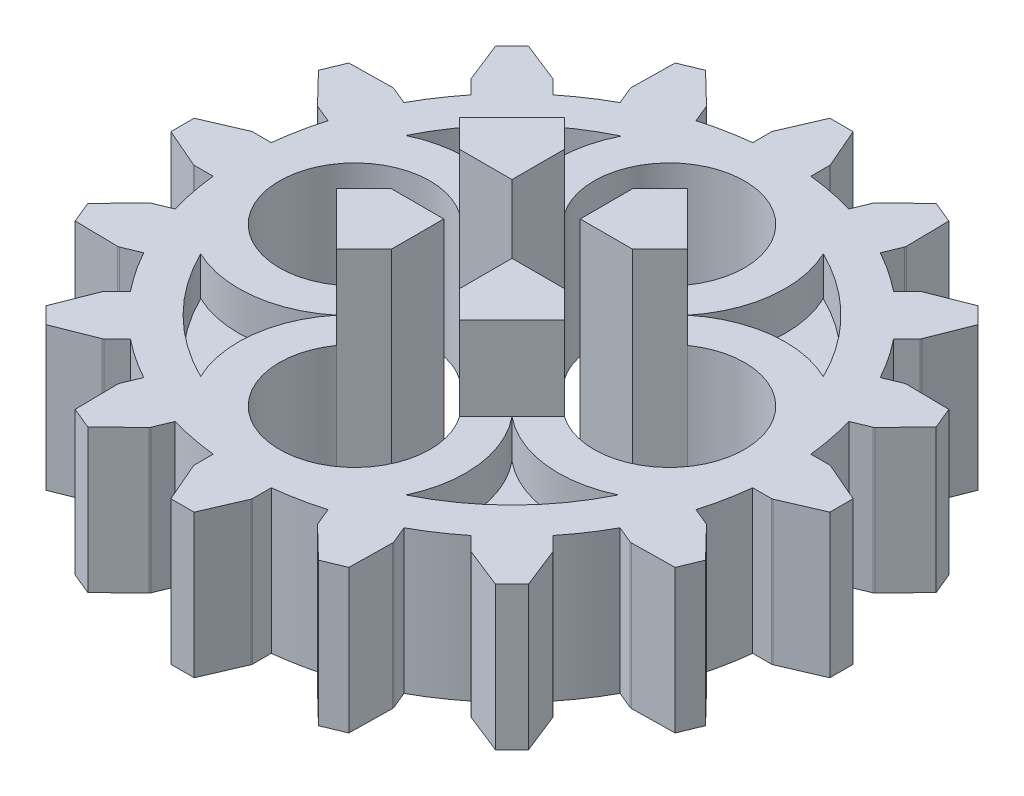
from build123d import *

# Parameters (mm, degrees)
BOSS_EXTRUDE4_DEPTH      = 3.7
CUT_EXTRUDE1_DEPTH       = 4
BOSS_EXTRUDE5_DEPTH      = 4
BOSS_EXTRUDE5_DEPTH_BACK = 4
CUT_EXTRUDE2_DEPTH       = 1
CUT_EXTRUDE3_DEPTH       = 4


with BuildPart() as part:
    # Sketch7 → Boss-Extrude4 (new body)
    with BuildSketch(Plane(origin=(0, 0, 0), x_dir=(1, 0, 0), z_dir=(0, 1, 0))):
        with BuildLine():
            ThreePointArc((-0.75, -6.959705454), (-0.375540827, -6.989919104), (0, -7))
            Line((0, -7), (0, 7))
            ThreePointArc((0, 7), (-0.375540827, 6.989919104), (-0.75, 6.959705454))
            ThreePointArc((-0.75, 6.959705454), (-1.365632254, 6.865496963), (-1.970454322, 6.716941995))
            ThreePointArc((-1.970454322, 6.716941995), (-2.678784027, 6.467156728), (-3.356273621, 6.142916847))
            ThreePointArc((-3.356273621, 6.142916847), (-3.888991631, 5.820287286), (-4.390924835, 5.451585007))
            ThreePointArc((-4.390924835, 5.451585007), (-4.949747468, 4.949747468), (-5.451585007, 4.390924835))
            ThreePointArc((-5.451585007, 4.390924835), (-5.820287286, 3.888991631), (-6.142916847, 3.356273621))
            ThreePointArc((-6.142916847, 3.356273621), (-6.467156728, 2.678784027), (-6.716941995, 1.970454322))
            ThreePointArc((-6.716941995, 1.970454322), (-6.865496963, 1.365632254), (-6.959705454, 0.75))
            ThreePointArc((-6.959705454, 0.75), (-7, 0), (-6.959705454, -0.75))
            ThreePointArc((-6.959705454, -0.75), (-6.865496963, -1.365632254), (-6.716941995, -1.970454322))
            ThreePointArc((-6.716941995, -1.970454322), (-6.467156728, -2.678784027), (-6.142916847, -3.356273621))
            ThreePointArc((-6.142916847, -3.356273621), (-5.820287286, -3.888991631), (-5.451585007, -4.390924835))
            ThreePointArc((-5.451585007, -4.390924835), (-4.949747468, -4.949747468), (-4.390924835, -5.451585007))
            ThreePointArc((-4.390924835, -5.451585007), (-3.888991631, -5.820287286), (-3.356273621, -6.142916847))
            ThreePointArc((-3.356273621, -6.142916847), (-2.678784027, -6.467156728), (-1.970454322, -6.716941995))
            ThreePointArc((-1.970454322, -6.716941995), (-1.365632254, -6.865496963), (-0.75, -6.959705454))
        make_face()
        with BuildLine():
            Line((0, 7), (0, -7))
            ThreePointArc((0, -7), (0.375540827, -6.989919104), (0.75, -6.959705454))
            ThreePointArc((0.75, -6.959705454), (1.365632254, -6.865496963), (1.970454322, -6.716941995))
            ThreePointArc((1.970454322, -6.716941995), (2.678784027, -6.467156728), (3.356273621, -6.142916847))
            ThreePointArc((3.356273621, -6.142916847), (3.888991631, -5.820287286), (4.390924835, -5.451585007))
            ThreePointArc((4.390924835, -5.451585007), (4.949747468, -4.949747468), (5.451585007, -4.390924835))
            ThreePointArc((5.451585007, -4.390924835), (5.820287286, -3.888991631), (6.142916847, -3.356273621))
            ThreePointArc((6.142916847, -3.356273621), (6.467156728, -2.678784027), (6.716941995, -1.970454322))
            ThreePointArc((6.716941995, -1.970454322), (6.865496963, -1.365632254), (6.959705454, -0.75))
            ThreePointArc((6.959705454, -0.75), (6.989919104, -0.375540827), (7, 0))
            ThreePointArc((7, 0), (6.989919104, 0.375540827), (6.959705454, 0.75))
            ThreePointArc((6.959705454, 0.75), (6.865496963, 1.365632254), (6.716941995, 1.970454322))
            ThreePointArc((6.716941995, 1.970454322), (6.467156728, 2.678784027), (6.142916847, 3.356273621))
            ThreePointArc((6.142916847, 3.356273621), (5.820287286, 3.888991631), (5.451585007, 4.390924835))
            ThreePointArc((5.451585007, 4.390924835), (4.949747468, 4.949747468), (4.390924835, 5.451585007))
            ThreePointArc((4.390924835, 5.451585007), (3.888991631, 5.820287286), (3.356273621, 6.142916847))
            ThreePointArc((3.356273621, 6.142916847), (2.678784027, 6.467156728), (1.970454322, 6.716941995))
            ThreePointArc((1.970454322, 6.716941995), (1.365632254, 6.865496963), (0.75, 6.959705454))
            ThreePointArc((0.75, 6.959705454), (0.375540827, 6.989919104), (0, 7))
        make_face()
        with BuildLine():
            ThreePointArc((-0.75, -6.959705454), (-0.375540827, -6.989919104), (0, -7))
            Line((0, -7), (0, 7))
            ThreePointArc((0, 7), (-0.375540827, 6.989919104), (-0.75, 6.959705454))
            ThreePointArc((-0.75, 6.959705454), (-1.365632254, 6.865496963), (-1.970454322, 6.716941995))
            ThreePointArc((-1.970454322, 6.716941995), (-2.678784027, 6.467156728), (-3.356273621, 6.142916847))
            ThreePointArc((-3.356273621, 6.142916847), (-3.888991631, 5.820287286), (-4.390924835, 5.451585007))
            ThreePointArc((-4.390924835, 5.451585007), (-4.949747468, 4.949747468), (-5.451585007, 4.390924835))
            ThreePointArc((-5.451585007, 4.390924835), (-5.820287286, 3.888991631), (-6.142916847, 3.356273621))
            ThreePointArc((-6.142916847, 3.356273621), (-6.467156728, 2.678784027), (-6.716941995, 1.970454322))
            ThreePointArc((-6.716941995, 1.970454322), (-6.865496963, 1.365632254), (-6.959705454, 0.75))
            ThreePointArc((-6.959705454, 0.75), (-7, 0), (-6.959705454, -0.75))
            ThreePointArc((-6.959705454, -0.75), (-6.865496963, -1.365632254), (-6.716941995, -1.970454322))
            ThreePointArc((-6.716941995, -1.970454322), (-6.467156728, -2.678784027), (-6.142916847, -3.356273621))
            ThreePointArc((-6.142916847, -3.356273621), (-5.820287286, -3.888991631), (-5.451585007, -4.390924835))
            ThreePointArc((-5.451585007, -4.390924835), (-4.949747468, -4.949747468), (-4.390924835, -5.451585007))
            ThreePointArc((-4.390924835, -5.451585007), (-3.888991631, -5.820287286), (-3.356273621, -6.142916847))
            ThreePointArc((-3.356273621, -6.142916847), (-2.678784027, -6.467156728), (-1.970454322, -6.716941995))
            ThreePointArc((-1.970454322, -6.716941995), (-1.365632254, -6.865496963), (-0.75, -6.959705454))
        make_face()
        with BuildLine():
            Line((0, 7), (0, -7))
            ThreePointArc((0, -7), (0.375540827, -6.989919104), (0.75, -6.959705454))
            ThreePointArc((0.75, -6.959705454), (1.365632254, -6.865496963), (1.970454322, -6.716941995))
            ThreePointArc((1.970454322, -6.716941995), (2.678784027, -6.467156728), (3.356273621, -6.142916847))
            ThreePointArc((3.356273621, -6.142916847), (3.888991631, -5.820287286), (4.390924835, -5.451585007))
            ThreePointArc((4.390924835, -5.451585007), (4.949747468, -4.949747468), (5.451585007, -4.390924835))
            ThreePointArc((5.451585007, -4.390924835), (5.820287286, -3.888991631), (6.142916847, -3.356273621))
            ThreePointArc((6.142916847, -3.356273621), (6.467156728, -2.678784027), (6.716941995, -1.970454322))
            ThreePointArc((6.716941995, -1.970454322), (6.865496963, -1.365632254), (6.959705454, -0.75))
            ThreePointArc((6.959705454, -0.75), (6.989919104, -0.375540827), (7, 0))
            ThreePointArc((7, 0), (6.989919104, 0.375540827), (6.959705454, 0.75))
            ThreePointArc((6.959705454, 0.75), (6.865496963, 1.365632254), (6.716941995, 1.970454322))
            ThreePointArc((6.716941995, 1.970454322), (6.467156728, 2.678784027), (6.142916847, 3.356273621))
            ThreePointArc((6.142916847, 3.356273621), (5.820287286, 3.888991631), (5.451585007, 4.390924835))
            ThreePointArc((5.451585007, 4.390924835), (4.949747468, 4.949747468), (4.390924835, 5.451585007))
            ThreePointArc((4.390924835, 5.451585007), (3.888991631, 5.820287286), (3.356273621, 6.142916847))
            ThreePointArc((3.356273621, 6.142916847), (2.678784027, 6.467156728), (1.970454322, 6.716941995))
            ThreePointArc((1.970454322, 6.716941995), (1.365632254, 6.865496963), (0.75, 6.959705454))
            ThreePointArc((0.75, 6.959705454), (0.375540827, 6.989919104), (0, 7))
        make_face()
        with BuildLine():
            Line((-2.153873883, -7.159755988), (-1.970454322, -6.716941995))
            ThreePointArc((-1.970454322, -6.716941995), (-2.678784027, -6.467156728), (-3.356273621, -6.142916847))
            Line((-3.356273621, -6.142916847), (-3.539693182, -6.585730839))
            ThreePointArc((-3.539693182, -6.585730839), (-3.545532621, -6.605254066), (-3.547293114, -6.625555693))
            Line((-3.547293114, -6.625555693), (-3.529973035, -7.738170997))
            Line((-3.529973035, -7.738170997), (-2.975645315, -7.967781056))
            Line((-2.975645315, -7.967781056), (-2.176660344, -7.193290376))
            ThreePointArc((-2.176660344, -7.193290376), (-2.163549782, -7.1776901), (-2.153873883, -7.159755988))
        make_face()
        with BuildLine():
            Line((-4.729839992, -5.790500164), (-4.390924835, -5.451585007))
            ThreePointArc((-4.390924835, -5.451585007), (-4.949747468, -4.949747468), (-5.451585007, -4.390924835))
            Line((-5.451585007, -4.390924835), (-5.790500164, -4.729839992))
            ThreePointArc((-5.790500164, -4.729839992), (-5.803366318, -4.745642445), (-5.812761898, -4.763724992))
            Line((-5.812761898, -4.763724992), (-6.222539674, -5.798275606))
            Line((-6.222539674, -5.798275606), (-5.798275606, -6.222539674))
            Line((-5.798275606, -6.222539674), (-4.763724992, -5.812761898))
            ThreePointArc((-4.763724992, -5.812761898), (-4.745642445, -5.803366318), (-4.729839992, -5.790500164))
        make_face()
        with BuildLine():
            Line((-6.585730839, -3.539693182), (-6.142916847, -3.356273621))
            ThreePointArc((-6.142916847, -3.356273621), (-6.467156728, -2.678784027), (-6.716941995, -1.970454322))
            Line((-6.716941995, -1.970454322), (-7.159755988, -2.153873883))
            ThreePointArc((-7.159755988, -2.153873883), (-7.1776901, -2.163549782), (-7.193290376, -2.176660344))
            Line((-7.193290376, -2.176660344), (-7.967781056, -2.975645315))
            Line((-7.967781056, -2.975645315), (-7.738170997, -3.529973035))
            Line((-7.738170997, -3.529973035), (-6.625555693, -3.547293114))
            ThreePointArc((-6.625555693, -3.547293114), (-6.605254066, -3.545532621), (-6.585730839, -3.539693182))
        make_face()
        with BuildLine():
            Line((-7.439003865, -0.75), (-6.959705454, -0.75))
            ThreePointArc((-6.959705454, -0.75), (-7, 0), (-6.959705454, 0.75))
            Line((-6.959705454, 0.75), (-7.439003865, 0.75))
            ThreePointArc((-7.439003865, 0.75), (-7.459275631, 0.747923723), (-7.478705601, 0.74178111))
            Line((-7.478705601, 0.74178111), (-8.5, 0.3))
            Line((-8.5, 0.3), (-8.5, -0.3))
            Line((-8.5, -0.3), (-7.478705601, -0.74178111))
            ThreePointArc((-7.478705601, -0.74178111), (-7.459275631, -0.747923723), (-7.439003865, -0.75))
        make_face()
        with BuildLine():
            ThreePointArc((-6.716941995, 1.970454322), (-6.467156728, 2.678784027), (-6.142916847, 3.356273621))
            Line((-6.142916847, 3.356273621), (-6.585730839, 3.539693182))
            ThreePointArc((-6.585730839, 3.539693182), (-6.605254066, 3.545532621), (-6.625555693, 3.547293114))
            Line((-6.625555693, 3.547293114), (-7.738170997, 3.529973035))
            Line((-7.738170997, 3.529973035), (-7.967781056, 2.975645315))
            Line((-7.967781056, 2.975645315), (-7.193290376, 2.176660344))
            ThreePointArc((-7.193290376, 2.176660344), (-7.1776901, 2.163549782), (-7.159755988, 2.153873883))
            Line((-7.159755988, 2.153873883), (-6.716941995, 1.970454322))
        make_face()
        with BuildLine():
            ThreePointArc((-5.451585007, 4.390924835), (-4.949747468, 4.949747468), (-4.390924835, 5.451585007))
            Line((-4.390924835, 5.451585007), (-4.729839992, 5.790500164))
            ThreePointArc((-4.729839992, 5.790500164), (-4.745642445, 5.803366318), (-4.763724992, 5.812761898))
            Line((-4.763724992, 5.812761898), (-5.798275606, 6.222539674))
            Line((-5.798275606, 6.222539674), (-6.222539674, 5.798275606))
            Line((-6.222539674, 5.798275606), (-5.812761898, 4.763724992))
            ThreePointArc((-5.812761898, 4.763724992), (-5.803366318, 4.745642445), (-5.790500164, 4.729839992))
            Line((-5.790500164, 4.729839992), (-5.451585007, 4.390924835))
        make_face()
        with BuildLine():
            ThreePointArc((-3.356273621, 6.142916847), (-2.678784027, 6.467156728), (-1.970454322, 6.716941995))
            Line((-1.970454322, 6.716941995), (-2.153873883, 7.159755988))
            ThreePointArc((-2.153873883, 7.159755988), (-2.163549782, 7.1776901), (-2.176660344, 7.193290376))
            Line((-2.176660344, 7.193290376), (-2.975645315, 7.967781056))
            Line((-2.975645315, 7.967781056), (-3.529973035, 7.738170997))
            Line((-3.529973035, 7.738170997), (-3.547293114, 6.625555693))
            ThreePointArc((-3.547293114, 6.625555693), (-3.545532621, 6.605254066), (-3.539693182, 6.585730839))
            Line((-3.539693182, 6.585730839), (-3.356273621, 6.142916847))
        make_face()
        with BuildLine():
            Line((2.153873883, 7.159755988), (1.970454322, 6.716941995))
            ThreePointArc((1.970454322, 6.716941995), (2.678784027, 6.467156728), (3.356273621, 6.142916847))
            Line((3.356273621, 6.142916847), (3.539693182, 6.585730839))
            ThreePointArc((3.539693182, 6.585730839), (3.545532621, 6.605254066), (3.547293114, 6.625555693))
            Line((3.547293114, 6.625555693), (3.529973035, 7.738170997))
            Line((3.529973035, 7.738170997), (2.975645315, 7.967781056))
            Line((2.975645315, 7.967781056), (2.176660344, 7.193290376))
            ThreePointArc((2.176660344, 7.193290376), (2.163549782, 7.1776901), (2.153873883, 7.159755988))
        make_face()
        with BuildLine():
            Line((0, 8.5), (0, 7))
            ThreePointArc((0, 7), (0.375540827, 6.989919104), (0.75, 6.959705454))
            Line((0.75, 6.959705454), (0.75, 7.439003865))
            ThreePointArc((0.75, 7.439003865), (0.747923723, 7.459275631), (0.74178111, 7.478705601))
            Line((0.74178111, 7.478705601), (0.3, 8.5))
            Line((0.3, 8.5), (0, 8.5))
        make_face()
        with BuildLine():
            ThreePointArc((-0.75, 6.959705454), (-0.375540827, 6.989919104), (0, 7))
            Line((0, 7), (0, 8.5))
            Line((0, 8.5), (-0.3, 8.5))
            Line((-0.3, 8.5), (-0.74178111, 7.478705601))
            ThreePointArc((-0.74178111, 7.478705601), (-0.747923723, 7.459275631), (-0.75, 7.439003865))
            Line((-0.75, 7.439003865), (-0.75, 6.959705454))
        make_face()
        with BuildLine():
            Line((4.729839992, 5.790500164), (4.390924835, 5.451585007))
            ThreePointArc((4.390924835, 5.451585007), (4.949747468, 4.949747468), (5.451585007, 4.390924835))
            Line((5.451585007, 4.390924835), (5.790500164, 4.729839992))
            ThreePointArc((5.790500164, 4.729839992), (5.803366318, 4.745642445), (5.812761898, 4.763724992))
            Line((5.812761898, 4.763724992), (6.222539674, 5.798275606))
            Line((6.222539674, 5.798275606), (5.798275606, 6.222539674))
            Line((5.798275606, 6.222539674), (4.763724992, 5.812761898))
            ThreePointArc((4.763724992, 5.812761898), (4.745642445, 5.803366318), (4.729839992, 5.790500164))
        make_face()
        with BuildLine():
            Line((6.585730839, 3.539693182), (6.142916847, 3.356273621))
            ThreePointArc((6.142916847, 3.356273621), (6.467156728, 2.678784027), (6.716941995, 1.970454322))
            Line((6.716941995, 1.970454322), (7.159755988, 2.153873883))
            ThreePointArc((7.159755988, 2.153873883), (7.1776901, 2.163549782), (7.193290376, 2.176660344))
            Line((7.193290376, 2.176660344), (7.967781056, 2.975645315))
            Line((7.967781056, 2.975645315), (7.738170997, 3.529973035))
            Line((7.738170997, 3.529973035), (6.625555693, 3.547293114))
            ThreePointArc((6.625555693, 3.547293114), (6.605254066, 3.545532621), (6.585730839, 3.539693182))
        make_face()
        with BuildLine():
            ThreePointArc((7, 0), (6.989919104, -0.375540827), (6.959705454, -0.75))
            Line((6.959705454, -0.75), (7.439003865, -0.75))
            ThreePointArc((7.439003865, -0.75), (7.459275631, -0.747923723), (7.478705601, -0.74178111))
            Line((7.478705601, -0.74178111), (8.5, -0.3))
            Line((8.5, -0.3), (8.5, 0.3))
            Line((8.5, 0.3), (7.478705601, 0.74178111))
            ThreePointArc((7.478705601, 0.74178111), (7.459275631, 0.747923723), (7.439003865, 0.75))
            Line((7.439003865, 0.75), (6.959705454, 0.75))
            ThreePointArc((6.959705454, 0.75), (6.989919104, 0.375540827), (7, 0))
        make_face()
        with BuildLine():
            ThreePointArc((6.716941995, -1.970454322), (6.467156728, -2.678784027), (6.142916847, -3.356273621))
            Line((6.142916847, -3.356273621), (6.585730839, -3.539693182))
            ThreePointArc((6.585730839, -3.539693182), (6.605254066, -3.545532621), (6.625555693, -3.547293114))
            Line((6.625555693, -3.547293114), (7.738170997, -3.529973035))
            Line((7.738170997, -3.529973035), (7.967781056, -2.975645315))
            Line((7.967781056, -2.975645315), (7.193290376, -2.176660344))
            ThreePointArc((7.193290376, -2.176660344), (7.1776901, -2.163549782), (7.159755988, -2.153873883))
            Line((7.159755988, -2.153873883), (6.716941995, -1.970454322))
        make_face()
        with BuildLine():
            ThreePointArc((5.451585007, -4.390924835), (4.949747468, -4.949747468), (4.390924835, -5.451585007))
            Line((4.390924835, -5.451585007), (4.729839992, -5.790500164))
            ThreePointArc((4.729839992, -5.790500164), (4.745642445, -5.803366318), (4.763724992, -5.812761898))
            Line((4.763724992, -5.812761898), (5.798275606, -6.222539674))
            Line((5.798275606, -6.222539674), (6.222539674, -5.798275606))
            Line((6.222539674, -5.798275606), (5.812761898, -4.763724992))
            ThreePointArc((5.812761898, -4.763724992), (5.803366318, -4.745642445), (5.790500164, -4.729839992))
            Line((5.790500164, -4.729839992), (5.451585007, -4.390924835))
        make_face()
        with BuildLine():
            ThreePointArc((3.356273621, -6.142916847), (2.678784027, -6.467156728), (1.970454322, -6.716941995))
            Line((1.970454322, -6.716941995), (2.153873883, -7.159755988))
            ThreePointArc((2.153873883, -7.159755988), (2.163549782, -7.1776901), (2.176660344, -7.193290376))
            Line((2.176660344, -7.193290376), (2.975645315, -7.967781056))
            Line((2.975645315, -7.967781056), (3.529973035, -7.738170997))
            Line((3.529973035, -7.738170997), (3.547293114, -6.625555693))
            ThreePointArc((3.547293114, -6.625555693), (3.545532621, -6.605254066), (3.539693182, -6.585730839))
            Line((3.539693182, -6.585730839), (3.356273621, -6.142916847))
        make_face()
        with BuildLine():
            Line((0, -7), (0, -8.5))
            Line((0, -8.5), (0.3, -8.5))
            Line((0.3, -8.5), (0.74178111, -7.478705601))
            ThreePointArc((0.74178111, -7.478705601), (0.747923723, -7.459275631), (0.75, -7.439003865))
            Line((0.75, -7.439003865), (0.75, -6.959705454))
            ThreePointArc((0.75, -6.959705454), (0.375540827, -6.989919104), (0, -7))
        make_face()
        with BuildLine():
            Line((-0.3, -8.5), (0, -8.5))
            Line((0, -8.5), (0, -7))
            ThreePointArc((0, -7), (-0.375540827, -6.989919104), (-0.75, -6.959705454))
            Line((-0.75, -6.959705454), (-0.75, -7.439003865))
            ThreePointArc((-0.75, -7.439003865), (-0.747923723, -7.459275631), (-0.74178111, -7.478705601))
            Line((-0.74178111, -7.478705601), (-0.3, -8.5))
        make_face()
    extrude(amount=BOSS_EXTRUDE4_DEPTH)

    # Sketch8 → Cut-Extrude1 (cut)
    with BuildSketch(Plane(origin=(0, 0, 0), x_dir=(1, 0, 0), z_dir=(0, 1, 0))):
        Polygon((0.88, -2.23), (0.88, -0.88), (2.23, -0.88), (2.23, 0.88), (0.88, 0.88), (0.88, 2.23), (-0.88, 2.23), (-0.88, 0.88), (-2.23, 0.88), (-2.23, -0.88), (-0.88, -0.88), (-0.88, -2.23), align=None)
    extrude(amount=CUT_EXTRUDE1_DEPTH, mode=Mode.SUBTRACT)

    # Sketch9 → Boss-Extrude5 (add, two sides: drawn at the far end of the back side and taken through both)
    with BuildSketch(Plane(origin=(0, 1.85, 0), x_dir=(1, 0, 0), z_dir=(0, 1, 0)).offset(-BOSS_EXTRUDE5_DEPTH_BACK)):
        Polygon((-2.23, 0.88), (-2.937106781, 1.587106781), (-1.587106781, 2.937106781), (-0.88, 2.23), (-0.88, 0.88), align=None)
        Polygon((0.88, 0.88), (2.23, 0.88), (2.937106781, 1.587106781), (1.587106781, 2.937106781), (0.88, 2.23), align=None)
        Polygon((0.88, -0.88), (0.88, -2.23), (1.587106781, -2.937106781), (2.937106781, -1.587106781), (2.23, -0.88), align=None)
        Polygon((-0.88, -0.88), (-2.23, -0.88), (-2.937106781, -1.587106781), (-1.587106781, -2.937106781), (-0.88, -2.23), align=None)
    extrude(amount=BOSS_EXTRUDE5_DEPTH + BOSS_EXTRUDE5_DEPTH_BACK)

    # Sketch10 → Cut-Extrude2 (cut)
    with BuildSketch(Plane(origin=(0, 3.7, 0), x_dir=(1, 0, 0), z_dir=(0, 1, 0))):
        with BuildLine():
            ThreePointArc((-4.443624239, 2.912509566), (-3.287118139, 2.807831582), (-2.262106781, 2.262106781))
            ThreePointArc((-2.262106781, 2.262106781), (-2.893119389, 3.787791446), (-2.592172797, 5.411158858))
            ThreePointArc((-2.592172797, 5.411158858), (-4.220633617, 4.264534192), (-5.384047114, 2.648025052))
            ThreePointArc((-5.384047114, 2.648025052), (-5.384920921, 2.646247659), (-5.385794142, 2.644469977))
            ThreePointArc((-5.385794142, 2.644469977), (-4.92599003, 2.818142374), (-4.443624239, 2.912509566))
        make_face()
        with BuildLine():
            ThreePointArc((2.262106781, 2.262106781), (3.769227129, 2.907509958), (5.387064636, 2.641880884))
            ThreePointArc((5.387064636, 2.641880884), (4.243660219, 4.24162091), (2.644469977, 5.385794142))
            ThreePointArc((2.644469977, 5.385794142), (2.908260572, 3.76825839), (2.262106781, 2.262106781))
        make_face()
        with BuildLine():
            ThreePointArc((2.262106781, -2.262106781), (2.909018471, -3.767280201), (2.647083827, -5.384509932))
            ThreePointArc((2.647083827, -5.384509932), (4.243670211, -4.241610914), (5.385794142, -2.644469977))
            ThreePointArc((5.385794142, -2.644469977), (3.76825839, -2.908260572), (2.262106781, -2.262106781))
        make_face()
        with BuildLine():
            ThreePointArc((-2.262106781, -2.262106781), (-3.76825839, -2.908260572), (-5.385794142, -2.644469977))
            ThreePointArc((-5.385794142, -2.644469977), (-4.243670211, -4.241610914), (-2.647083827, -5.384509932))
            ThreePointArc((-2.647083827, -5.384509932), (-2.909018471, -3.767280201), (-2.262106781, -2.262106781))
        make_face()
    cut_extrude2 = extrude(amount=-CUT_EXTRUDE2_DEPTH, mode=Mode.SUBTRACT)

    # Sketch13 → Cut-Extrude3 (cut)
    with BuildSketch(Plane(origin=(0, 3.7, 0), x_dir=(1, 0, 0), z_dir=(0, 1, 0))):
        with BuildLine():
            Line((-2.937106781, 1.587106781), (-2.23, 0.88))
            Line((-2.23, 0.88), (-2.23, -0.88))
            Line((-2.23, -0.88), (-2.937106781, -1.587106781))
            ThreePointArc((-2.937106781, -1.587106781), (-6, 0), (-2.937106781, 1.587106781))
        make_face()
        with BuildLine():
            Line((-0.88, 2.23), (-1.587106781, 2.937106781))
            ThreePointArc((-1.587106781, 2.937106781), (0, 6), (1.587106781, 2.937106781))
            Line((1.587106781, 2.937106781), (0.88, 2.23))
            Line((0.88, 2.23), (-0.88, 2.23))
        make_face()
        with BuildLine():
            Line((2.23, 0.88), (2.937106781, 1.587106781))
            ThreePointArc((2.937106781, 1.587106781), (6, 0), (2.937106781, -1.587106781))
            Line((2.937106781, -1.587106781), (2.23, -0.88))
            Line((2.23, -0.88), (2.23, 0.88))
        make_face()
        with BuildLine():
            Line((0.88, -2.23), (1.587106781, -2.937106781))
            ThreePointArc((1.587106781, -2.937106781), (0, -6), (-1.587106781, -2.937106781))
            Line((-1.587106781, -2.937106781), (-0.88, -2.23))
            Line((-0.88, -2.23), (0.88, -2.23))
        make_face()
    extrude(amount=-CUT_EXTRUDE3_DEPTH, mode=Mode.SUBTRACT)

    # Mirror4: Cut-Extrude2 across plane
    add(cut_extrude2.mirror(Plane.ZX.offset(1.85)), mode=Mode.SUBTRACT)


solid = part.part
